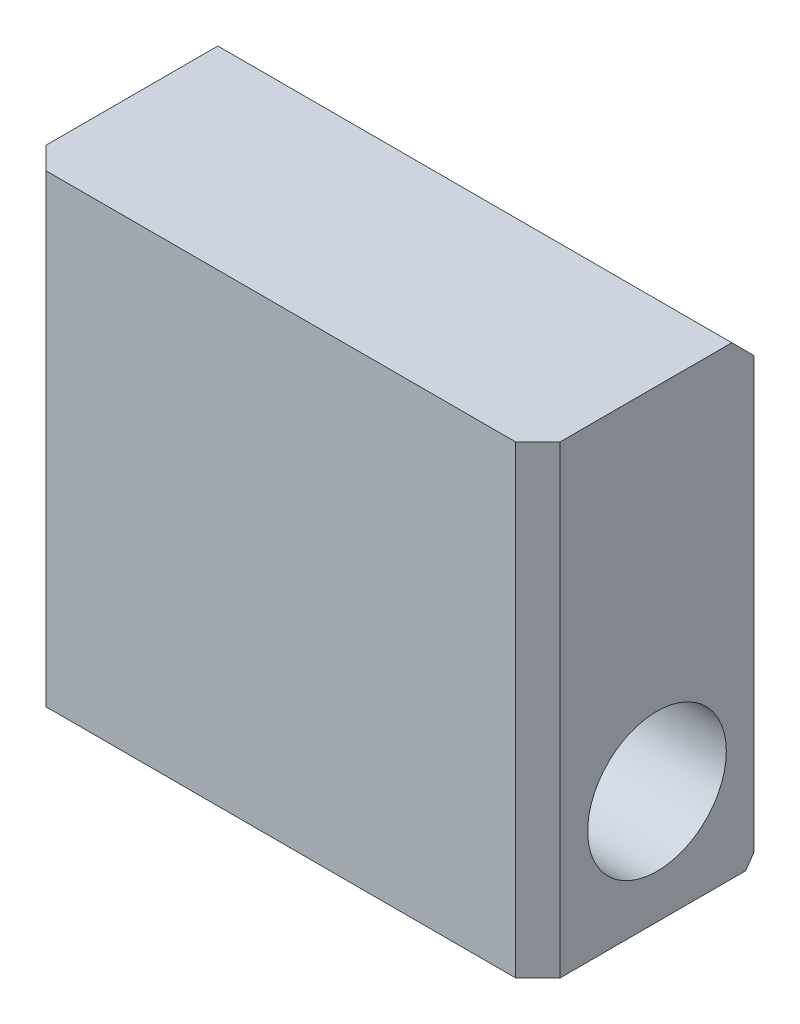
from build123d import *

# Parameters (mm, degrees)
SKETCH_1_W          = 12.2936
SKETCH_1_H          = 23.9522
SKETCH_1_R          = 3.57759
EXTRUDE_1_DEPTH     = 13.2588
CHAMFER_1_SIZE      = 1.143
CUT_EXTRUDE_1_DEPTH = 33.694733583


with BuildPart() as part:
    # Sketch 1 → Extrude 1 (new, symmetric)
    with BuildSketch(Plane(origin=(0, 0, 0), x_dir=(0, 0, -1), z_dir=(1, 0, 0))):
        with Locations((0, 6.1341)):
            Rectangle(SKETCH_1_W, SKETCH_1_H)
        Circle(SKETCH_1_R, mode=Mode.SUBTRACT)
    extrude(amount=EXTRUDE_1_DEPTH, both=True)

    # Chamfer 1
    chamfer_1_edges = [part.edges().sort_by_distance(p)[0] for p in [
        (13.2588, 6.1341, -6.1468),
        (13.2588, 6.1341, 6.1468),
        (-13.2588, 6.1341, -6.1468),
        (-13.2588, 6.1341, 6.1468),
    ]]
    chamfer(chamfer_1_edges, length=CHAMFER_1_SIZE)

    # Sketch 2 → Cut-Extrude 1 (cut, through all)
    with BuildSketch(Plane(origin=(13.2588, 0, 0), x_dir=(0, 0, -1), z_dir=(1, 0, 0))):
        Polygon((4.572, -5.842), (6.1468, -3.592952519), (6.1468, -5.842), align=None)
        Polygon((3.8608, 18.1102), (6.1468, 18.1102), (6.1468, 13.506011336), (5.338142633, 16.632857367), align=None)
    extrude(amount=-CUT_EXTRUDE_1_DEPTH, mode=Mode.SUBTRACT)


solid = part.part
